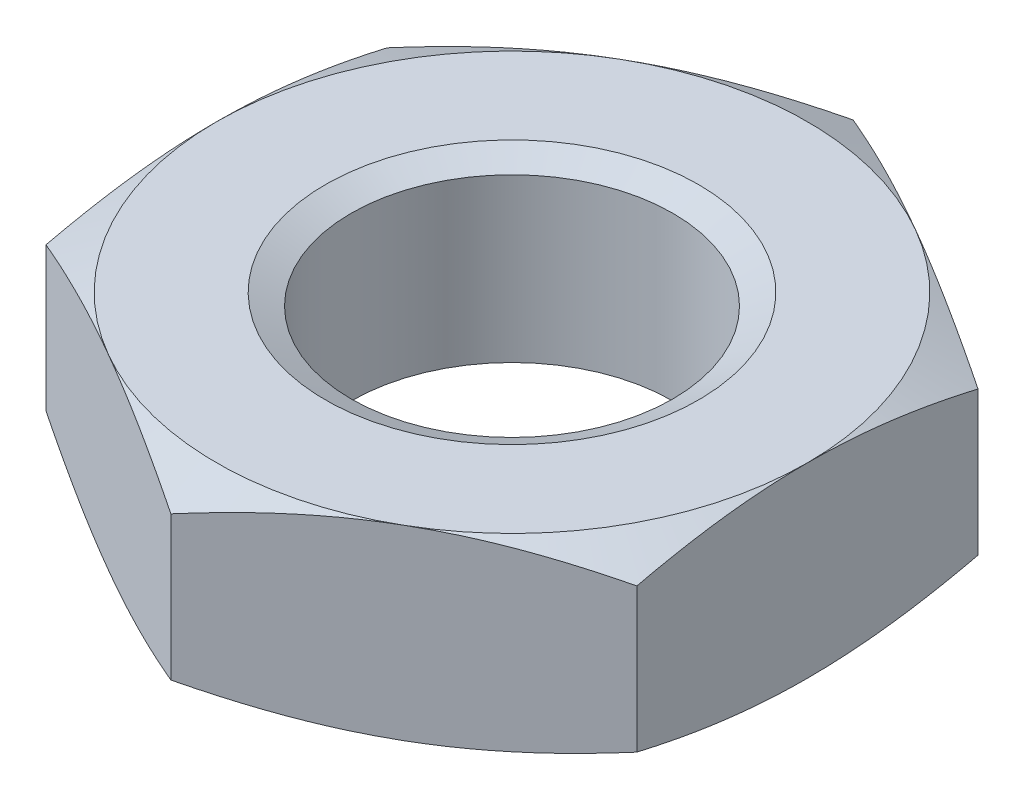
ISO-10303-21;
HEADER;
FILE_DESCRIPTION(('STEP AP214'),'2;1');
FILE_NAME('part.step','',(''),(''),'','','');
FILE_SCHEMA(('AUTOMOTIVE_DESIGN { 1 0 10303 214 1 1 1 1 }'));
ENDSEC;
DATA;
#1=APPLICATION_CONTEXT('core data for automotive mechanical design processes');
#2=APPLICATION_PROTOCOL_DEFINITION('international standard','automotive_design',2000,#1);
#3=PRODUCT_CONTEXT('',#1,'mechanical');
#4=PRODUCT('Part','Part','',(#3));
#5=PRODUCT_RELATED_PRODUCT_CATEGORY('part','',(#4));
#6=PRODUCT_DEFINITION_FORMATION('','',#4);
#7=PRODUCT_DEFINITION_CONTEXT('part definition',#1,'design');
#8=PRODUCT_DEFINITION('design','',#6,#7);
#9=PRODUCT_DEFINITION_SHAPE('','',#8);
#10=(LENGTH_UNIT() NAMED_UNIT(*) SI_UNIT(.MILLI.,.METRE.));
#11=(NAMED_UNIT(*) PLANE_ANGLE_UNIT() SI_UNIT($,.RADIAN.));
#12=(NAMED_UNIT(*) SI_UNIT($,.STERADIAN.) SOLID_ANGLE_UNIT());
#13=UNCERTAINTY_MEASURE_WITH_UNIT(LENGTH_MEASURE(1.E-05),#10,'distance_accuracy_value','');
#14=(GEOMETRIC_REPRESENTATION_CONTEXT(3) GLOBAL_UNCERTAINTY_ASSIGNED_CONTEXT((#13)) GLOBAL_UNIT_ASSIGNED_CONTEXT((#10,
#11,#12)) REPRESENTATION_CONTEXT('',''));
#15=CARTESIAN_POINT('',(0.,0.,0.));
#16=DIRECTION('',(0.,0.,1.));
#17=DIRECTION('',(1.,0.,0.));
#18=AXIS2_PLACEMENT_3D('',#15,#16,#17);
#19=CARTESIAN_POINT('',(0.,3.,-10.9696551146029));
#20=DIRECTION('',(0.,1.,0.));
#21=DIRECTION('',(0.,0.,1.));
#22=AXIS2_PLACEMENT_3D('',#19,#20,#21);
#23=PLANE('',#22);
#24=CARTESIAN_POINT('',(0.,3.,0.));
#25=DIRECTION('',(0.,-1.,0.));
#26=DIRECTION('',(0.,0.,-1.));
#27=AXIS2_PLACEMENT_3D('',#24,#25,#26);
#28=CIRCLE('',#27,9.50000000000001);
#29=CARTESIAN_POINT('',(-4.75000000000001,3.,8.22724133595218));
#30=VERTEX_POINT('',#29);
#31=CARTESIAN_POINT('',(-9.50000000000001,3.,0.));
#32=VERTEX_POINT('',#31);
#33=EDGE_CURVE('E298',#30,#32,#28,.T.);
#34=ORIENTED_EDGE('',*,*,#33,.F.);
#35=CARTESIAN_POINT('',(4.75,3.,8.22724133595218));
#36=VERTEX_POINT('',#35);
#37=EDGE_CURVE('E295',#36,#30,#28,.T.);
#38=ORIENTED_EDGE('',*,*,#37,.F.);
#39=CARTESIAN_POINT('',(9.50000000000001,3.,0.));
#40=VERTEX_POINT('',#39);
#41=EDGE_CURVE('E290',#40,#36,#28,.T.);
#42=ORIENTED_EDGE('',*,*,#41,.F.);
#43=CARTESIAN_POINT('',(4.75000000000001,3.,-8.22724133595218));
#44=VERTEX_POINT('',#43);
#45=EDGE_CURVE('E159',#44,#40,#28,.T.);
#46=ORIENTED_EDGE('',*,*,#45,.F.);
#47=CARTESIAN_POINT('',(-4.75000000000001,3.,-8.22724133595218));
#48=VERTEX_POINT('',#47);
#49=EDGE_CURVE('E291',#48,#44,#28,.T.);
#50=ORIENTED_EDGE('',*,*,#49,.F.);
#51=EDGE_CURVE('E296',#32,#48,#28,.T.);
#52=ORIENTED_EDGE('',*,*,#51,.F.);
#53=EDGE_LOOP('',(#34,#38,#42,#46,#50,#52));
#54=FACE_BOUND('',#53,.T.);
#55=CARTESIAN_POINT('',(0.,3.,0.));
#56=DIRECTION('',(0.,-1.,0.));
#57=DIRECTION('',(0.,0.,-1.));
#58=AXIS2_PLACEMENT_3D('',#55,#56,#57);
#59=CIRCLE('',#58,6.);
#60=CARTESIAN_POINT('',(0.,3.,-6.));
#61=VERTEX_POINT('',#60);
#62=EDGE_CURVE('E260',#61,#61,#59,.T.);
#63=ORIENTED_EDGE('',*,*,#62,.T.);
#64=EDGE_LOOP('',(#63));
#65=FACE_BOUND('',#64,.T.);
#66=ADVANCED_FACE('F38',(#54,#65),#23,.T.);
#67=CARTESIAN_POINT('',(0.,-3.,-10.9696551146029));
#68=DIRECTION('',(0.,1.,0.));
#69=DIRECTION('',(0.,0.,1.));
#70=AXIS2_PLACEMENT_3D('',#67,#68,#69);
#71=PLANE('',#70);
#72=CARTESIAN_POINT('',(0.,-3.,0.));
#73=DIRECTION('',(0.,-1.,0.));
#74=DIRECTION('',(0.,0.,-1.));
#75=AXIS2_PLACEMENT_3D('',#72,#73,#74);
#76=CIRCLE('',#75,6.);
#77=CARTESIAN_POINT('',(0.,-3.,-6.));
#78=VERTEX_POINT('',#77);
#79=EDGE_CURVE('E251',#78,#78,#76,.T.);
#80=ORIENTED_EDGE('',*,*,#79,.F.);
#81=EDGE_LOOP('',(#80));
#82=FACE_BOUND('',#81,.T.);
#83=CARTESIAN_POINT('',(0.,-3.,0.));
#84=DIRECTION('',(0.,-1.,0.));
#85=DIRECTION('',(0.,0.,-1.));
#86=AXIS2_PLACEMENT_3D('',#83,#84,#85);
#87=CIRCLE('',#86,9.50000000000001);
#88=CARTESIAN_POINT('',(4.75,-3.,8.22724133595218));
#89=VERTEX_POINT('',#88);
#90=CARTESIAN_POINT('',(-4.75000000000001,-3.,8.22724133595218));
#91=VERTEX_POINT('',#90);
#92=EDGE_CURVE('E284',#89,#91,#87,.T.);
#93=ORIENTED_EDGE('',*,*,#92,.T.);
#94=CARTESIAN_POINT('',(-9.50000000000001,-3.,0.));
#95=VERTEX_POINT('',#94);
#96=EDGE_CURVE('E282',#91,#95,#87,.T.);
#97=ORIENTED_EDGE('',*,*,#96,.T.);
#98=CARTESIAN_POINT('',(-4.75000000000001,-3.,-8.22724133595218));
#99=VERTEX_POINT('',#98);
#100=EDGE_CURVE('E158',#95,#99,#87,.T.);
#101=ORIENTED_EDGE('',*,*,#100,.T.);
#102=CARTESIAN_POINT('',(4.75000000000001,-3.,-8.22724133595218));
#103=VERTEX_POINT('',#102);
#104=EDGE_CURVE('E133',#99,#103,#87,.T.);
#105=ORIENTED_EDGE('',*,*,#104,.T.);
#106=CARTESIAN_POINT('',(9.50000000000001,-3.,0.));
#107=VERTEX_POINT('',#106);
#108=EDGE_CURVE('E144',#103,#107,#87,.T.);
#109=ORIENTED_EDGE('',*,*,#108,.T.);
#110=EDGE_CURVE('E152',#107,#89,#87,.T.);
#111=ORIENTED_EDGE('',*,*,#110,.T.);
#112=EDGE_LOOP('',(#93,#97,#101,#105,#109,#111));
#113=FACE_BOUND('',#112,.T.);
#114=ADVANCED_FACE('F155',(#82,#113),#71,.F.);
#115=CARTESIAN_POINT('',(0.,2.61444946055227,0.));
#116=DIRECTION('',(0.,1.,0.));
#117=DIRECTION('',(0.,0.,1.));
#118=AXIS2_PLACEMENT_3D('',#115,#116,#117);
#119=CONICAL_SURFACE('',#118,5.17318419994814,1.13446401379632);
#120=ORIENTED_EDGE('',*,*,#62,.F.);
#121=EDGE_LOOP('',(#120));
#122=FACE_BOUND('',#121,.T.);
#123=CARTESIAN_POINT('',(0.,2.61444946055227,0.));
#124=DIRECTION('',(0.,-1.,0.));
#125=DIRECTION('',(0.,0.,-1.));
#126=AXIS2_PLACEMENT_3D('',#123,#124,#125);
#127=CIRCLE('',#126,5.17318419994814);
#128=CARTESIAN_POINT('',(0.,2.61444946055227,-5.17318419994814));
#129=VERTEX_POINT('',#128);
#130=EDGE_CURVE('E257',#129,#129,#127,.T.);
#131=ORIENTED_EDGE('',*,*,#130,.T.);
#132=EDGE_LOOP('',(#131));
#133=FACE_BOUND('',#132,.T.);
#134=ADVANCED_FACE('F348',(#122,#133),#119,.F.);
#135=CARTESIAN_POINT('',(0.,3.,0.));
#136=DIRECTION('',(0.,-1.,0.));
#137=DIRECTION('',(0.,0.,-1.));
#138=AXIS2_PLACEMENT_3D('',#135,#136,#137);
#139=CYLINDRICAL_SURFACE('',#138,5.17318419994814);
#140=ORIENTED_EDGE('',*,*,#130,.F.);
#141=EDGE_LOOP('',(#140));
#142=FACE_BOUND('',#141,.T.);
#143=CARTESIAN_POINT('',(0.,-2.61444946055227,0.));
#144=DIRECTION('',(0.,-1.,0.));
#145=DIRECTION('',(0.,0.,-1.));
#146=AXIS2_PLACEMENT_3D('',#143,#144,#145);
#147=CIRCLE('',#146,5.17318419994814);
#148=CARTESIAN_POINT('',(0.,-2.61444946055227,-5.17318419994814));
#149=VERTEX_POINT('',#148);
#150=EDGE_CURVE('E254',#149,#149,#147,.T.);
#151=ORIENTED_EDGE('',*,*,#150,.T.);
#152=EDGE_LOOP('',(#151));
#153=FACE_BOUND('',#152,.T.);
#154=ADVANCED_FACE('F353',(#142,#153),#139,.F.);
#155=CARTESIAN_POINT('',(0.,-3.,0.));
#156=DIRECTION('',(0.,-1.,0.));
#157=DIRECTION('',(0.,0.,-1.));
#158=AXIS2_PLACEMENT_3D('',#155,#156,#157);
#159=CONICAL_SURFACE('',#158,6.,1.13446401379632);
#160=ORIENTED_EDGE('',*,*,#150,.F.);
#161=EDGE_LOOP('',(#160));
#162=FACE_BOUND('',#161,.T.);
#163=ORIENTED_EDGE('',*,*,#79,.T.);
#164=EDGE_LOOP('',(#163));
#165=FACE_BOUND('',#164,.T.);
#166=ADVANCED_FACE('F193',(#162,#165),#159,.F.);
#167=CARTESIAN_POINT('',(0.,-2.31468856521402,0.));
#168=DIRECTION('',(0.,1.,0.));
#169=DIRECTION('',(0.,0.,1.));
#170=AXIS2_PLACEMENT_3D('',#167,#168,#169);
#171=CONICAL_SURFACE('',#170,10.9696551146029,1.13446401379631);
#172=ORIENTED_EDGE('',*,*,#92,.F.);
#173=CARTESIAN_POINT('',(-0.000200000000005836,-2.31463471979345,10.9697705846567));
#174=CARTESIAN_POINT('',(0.287096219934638,-2.3919802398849,10.8039000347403));
#175=CARTESIAN_POINT('',(0.575452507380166,-2.4643586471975,10.6374174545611));
#176=CARTESIAN_POINT('',(1.15432895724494,-2.59745715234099,10.3032029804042));
#177=CARTESIAN_POINT('',(1.44485020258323,-2.65817094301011,10.1354704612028));
#178=CARTESIAN_POINT('',(2.02806320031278,-2.76617947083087,9.79875227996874));
#179=CARTESIAN_POINT('',(2.32075673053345,-2.81346158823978,9.62976559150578));
#180=CARTESIAN_POINT('',(2.90764430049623,-2.89286146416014,9.29092589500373));
#181=CARTESIAN_POINT('',(3.20183804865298,-2.92498206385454,9.12107305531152));
#182=CARTESIAN_POINT('',(3.78512703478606,-2.97228457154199,8.78431100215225));
#183=CARTESIAN_POINT('',(4.07420151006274,-2.98780388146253,8.6174137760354));
#184=CARTESIAN_POINT('',(4.6526838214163,-3.00242203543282,8.28342685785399));
#185=CARTESIAN_POINT('',(4.9420916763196,-3.00151990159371,8.11633715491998));
#186=CARTESIAN_POINT('',(5.52024486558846,-2.98334062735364,7.78254025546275));
#187=CARTESIAN_POINT('',(5.80899056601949,-2.96607874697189,7.61583284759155));
#188=CARTESIAN_POINT('',(6.38542685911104,-2.91592315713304,7.28302719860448));
#189=CARTESIAN_POINT('',(6.67311754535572,-2.88303086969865,7.11692890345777));
#190=CARTESIAN_POINT('',(7.17283351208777,-2.81323110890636,6.82841775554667));
#191=CARTESIAN_POINT('',(7.38520520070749,-2.77955632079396,6.70580490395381));
#192=CARTESIAN_POINT('',(7.80897776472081,-2.70493481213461,6.46113970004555));
#193=CARTESIAN_POINT('',(8.02037868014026,-2.66398839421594,6.33908732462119));
#194=CARTESIAN_POINT('',(8.44384293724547,-2.57513594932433,6.09460012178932));
#195=CARTESIAN_POINT('',(8.65589776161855,-2.52717620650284,5.97217021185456));
#196=CARTESIAN_POINT('',(9.07888620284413,-2.42524395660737,5.72795772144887));
#197=CARTESIAN_POINT('',(9.28982000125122,-2.37127245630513,5.60617503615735));
#198=CARTESIAN_POINT('',(9.50019999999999,-2.31463471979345,5.48471208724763));
#199=B_SPLINE_CURVE_WITH_KNOTS('',3,(#173,#174,#175,#176,#177,#178,#179,#180,#181,#182,#183,
#184,#185,#186,#187,#188,#189,#190,#191,#192,#193,#194,#195,#196,#197,#198),.UNSPECIFIED.,.F.,
.F.,(4,2,2,2,2,2,2,2,2,2,2,2,4),(0.,1.02197309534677,2.04449723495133,3.06797893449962,
4.09126876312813,5.09334145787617,6.09547382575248,7.09667234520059,8.09777979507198,
8.84025230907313,9.58269393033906,10.3311528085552,11.0794865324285),.UNSPECIFIED.);
#200=CARTESIAN_POINT('',(0.,-2.31468856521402,10.9696551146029));
#201=VERTEX_POINT('',#200);
#202=EDGE_CURVE('E572',#201,#89,#199,.T.);
#203=ORIENTED_EDGE('',*,*,#202,.F.);
#204=CARTESIAN_POINT('',(-9.5002,-2.31463471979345,5.48471208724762));
#205=CARTESIAN_POINT('',(-9.21290378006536,-2.3919802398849,5.65058263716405));
#206=CARTESIAN_POINT('',(-8.92454749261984,-2.4643586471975,5.81706521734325));
#207=CARTESIAN_POINT('',(-8.34567104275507,-2.59745715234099,6.15127969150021));
#208=CARTESIAN_POINT('',(-8.05514979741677,-2.65817094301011,6.31901221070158));
#209=CARTESIAN_POINT('',(-7.47193679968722,-2.76617947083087,6.65573039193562));
#210=CARTESIAN_POINT('',(-7.17924326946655,-2.81346158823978,6.82471708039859));
#211=CARTESIAN_POINT('',(-6.59235569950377,-2.89286146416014,7.16355677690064));
#212=CARTESIAN_POINT('',(-6.29816195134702,-2.92498206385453,7.33340961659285));
#213=CARTESIAN_POINT('',(-5.71487296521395,-2.97228457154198,7.67017166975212));
#214=CARTESIAN_POINT('',(-5.42579848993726,-2.98780388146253,7.83706889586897));
#215=CARTESIAN_POINT('',(-4.84731617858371,-3.00242203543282,8.17105581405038));
#216=CARTESIAN_POINT('',(-4.55790832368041,-3.00151990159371,8.33814551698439));
#217=CARTESIAN_POINT('',(-3.97975513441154,-2.98334062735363,8.67194241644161));
#218=CARTESIAN_POINT('',(-3.69100943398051,-2.96607874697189,8.83864982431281));
#219=CARTESIAN_POINT('',(-3.11457314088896,-2.91592315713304,9.17145547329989));
#220=CARTESIAN_POINT('',(-2.82688245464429,-2.88303086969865,9.3375537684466));
#221=CARTESIAN_POINT('',(-2.32716648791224,-2.81323110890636,9.6260649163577));
#222=CARTESIAN_POINT('',(-2.11479479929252,-2.77955632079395,9.74867776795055));
#223=CARTESIAN_POINT('',(-1.6910222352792,-2.70493481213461,9.99334297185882));
#224=CARTESIAN_POINT('',(-1.47962131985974,-2.66398839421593,10.1153953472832));
#225=CARTESIAN_POINT('',(-1.05615706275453,-2.57513594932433,10.3598825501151));
#226=CARTESIAN_POINT('',(-0.844102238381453,-2.52717620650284,10.4823124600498));
#227=CARTESIAN_POINT('',(-0.421113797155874,-2.42524395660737,10.7265249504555));
#228=CARTESIAN_POINT('',(-0.210179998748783,-2.37127245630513,10.848307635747));
#229=CARTESIAN_POINT('',(0.000199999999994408,-2.31463471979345,10.9697705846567));
#230=B_SPLINE_CURVE_WITH_KNOTS('',3,(#204,#205,#206,#207,#208,#209,#210,#211,#212,#213,#214,
#215,#216,#217,#218,#219,#220,#221,#222,#223,#224,#225,#226,#227,#228,#229),.UNSPECIFIED.,.F.,
.F.,(4,2,2,2,2,2,2,2,2,2,2,2,4),(0.,1.02197309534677,2.04449723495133,3.06797893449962,
4.09126876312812,5.09334145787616,6.09547382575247,7.09667234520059,8.09777979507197,
8.84025230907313,9.58269393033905,10.3311528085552,11.0794865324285),.UNSPECIFIED.);
#231=EDGE_CURVE('E213',#91,#201,#230,.T.);
#232=ORIENTED_EDGE('',*,*,#231,.F.);
#233=EDGE_LOOP('',(#172,#203,#232));
#234=FACE_BOUND('',#233,.T.);
#235=ADVANCED_FACE('F360',(#234),#171,.T.);
#236=ORIENTED_EDGE('',*,*,#110,.F.);
#237=CARTESIAN_POINT('',(9.49999999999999,0.668970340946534,-14.5396705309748));
#238=CARTESIAN_POINT('',(9.49999999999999,0.502355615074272,-14.1127317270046));
#239=CARTESIAN_POINT('',(9.49999999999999,0.337561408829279,-13.6850690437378));
#240=CARTESIAN_POINT('',(9.49999999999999,0.0126466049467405,-12.827912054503));
#241=CARTESIAN_POINT('',(9.49999999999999,-0.147473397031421,-12.3984175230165));
#242=CARTESIAN_POINT('',(9.49999999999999,-0.462497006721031,-11.5358628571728));
#243=CARTESIAN_POINT('',(9.49999999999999,-0.617381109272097,-11.1027955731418));
#244=CARTESIAN_POINT('',(9.49999999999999,-0.919891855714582,-10.2341405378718));
#245=CARTESIAN_POINT('',(9.49999999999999,-1.06751875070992,-9.79855287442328));
#246=CARTESIAN_POINT('',(9.49999999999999,-1.35174201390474,-8.93016285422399));
#247=CARTESIAN_POINT('',(9.49999999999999,-1.48845860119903,-8.49740004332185));
#248=CARTESIAN_POINT('',(9.49999999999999,-1.7506615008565,-7.6284359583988));
#249=CARTESIAN_POINT('',(9.49999999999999,-1.8761472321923,-7.19223450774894));
#250=CARTESIAN_POINT('',(9.49999999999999,-2.11279756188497,-6.31639229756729));
#251=CARTESIAN_POINT('',(9.49999999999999,-2.22397611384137,-5.87675533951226));
#252=CARTESIAN_POINT('',(9.49999999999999,-2.42853145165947,-4.99335349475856));
#253=CARTESIAN_POINT('',(9.49999999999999,-2.52191072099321,-4.54958919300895));
#254=CARTESIAN_POINT('',(9.49999999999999,-2.6606442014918,-3.79933724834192));
#255=CARTESIAN_POINT('',(9.49999999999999,-2.71183849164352,-3.49392988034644));
#256=CARTESIAN_POINT('',(9.49999999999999,-2.80269954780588,-2.88139353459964));
#257=CARTESIAN_POINT('',(9.49999999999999,-2.84236659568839,-2.57426459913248));
#258=CARTESIAN_POINT('',(9.49999999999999,-2.90896894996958,-1.95876414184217));
#259=CARTESIAN_POINT('',(9.49999999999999,-2.93591030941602,-1.65039328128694));
#260=CARTESIAN_POINT('',(9.49999999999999,-2.9761814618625,-1.03275641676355));
#261=CARTESIAN_POINT('',(9.49999999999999,-2.98951136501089,-0.723490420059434));
#262=CARTESIAN_POINT('',(9.49999999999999,-3.00210305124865,-0.103357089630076));
#263=CARTESIAN_POINT('',(9.49999999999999,-3.00130496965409,0.207511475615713));
#264=CARTESIAN_POINT('',(9.49999999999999,-2.98552397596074,0.828887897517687));
#265=CARTESIAN_POINT('',(9.49999999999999,-2.97054087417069,1.13939574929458));
#266=CARTESIAN_POINT('',(9.49999999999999,-2.92693002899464,1.7594954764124));
#267=CARTESIAN_POINT('',(9.49999999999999,-2.89829994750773,2.06908718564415));
#268=CARTESIAN_POINT('',(9.49999999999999,-2.82835889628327,2.68680656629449));
#269=CARTESIAN_POINT('',(9.49999999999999,-2.7870483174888,2.99493428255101));
#270=CARTESIAN_POINT('',(9.49999999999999,-2.67642858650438,3.71745598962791));
#271=CARTESIAN_POINT('',(9.49999999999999,-2.6023820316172,4.1311241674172));
#272=CARTESIAN_POINT('',(9.49999999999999,-2.43665717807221,4.95495044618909));
#273=CARTESIAN_POINT('',(9.49999999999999,-2.34497487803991,5.3651077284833));
#274=CARTESIAN_POINT('',(9.49999999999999,-2.14707643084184,6.18227931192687));
#275=CARTESIAN_POINT('',(9.49999999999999,-2.04084662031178,6.58929027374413));
#276=CARTESIAN_POINT('',(9.49999999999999,-1.81669731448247,7.40002671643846));
#277=CARTESIAN_POINT('',(9.49999999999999,-1.69877855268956,7.8037524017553));
#278=CARTESIAN_POINT('',(9.49999999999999,-1.45285081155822,8.61054836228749));
#279=CARTESIAN_POINT('',(9.5,-1.32478953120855,9.01360260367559));
#280=CARTESIAN_POINT('',(9.5,-1.06100984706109,9.81719096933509));
#281=CARTESIAN_POINT('',(9.5,-0.925291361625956,10.2177250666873));
#282=CARTESIAN_POINT('',(9.5,-0.64773313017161,11.0164402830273));
#283=CARTESIAN_POINT('',(9.5,-0.505896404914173,11.4146224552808));
#284=CARTESIAN_POINT('',(9.5,-0.217190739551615,12.2091507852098));
#285=CARTESIAN_POINT('',(9.5,-0.0703218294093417,12.6054969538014));
#286=CARTESIAN_POINT('',(9.5,0.228120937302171,13.3981671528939));
#287=CARTESIAN_POINT('',(9.5,0.379710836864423,13.7944851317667));
#288=CARTESIAN_POINT('',(9.5,0.686334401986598,14.5857880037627));
#289=CARTESIAN_POINT('',(9.5,0.841368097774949,14.9807728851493));
#290=CARTESIAN_POINT('',(9.5,1.310779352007,16.164126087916));
#291=CARTESIAN_POINT('',(9.5,1.62943155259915,16.9507994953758));
#292=CARTESIAN_POINT('',(9.5,2.11140168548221,18.1232822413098));
#293=CARTESIAN_POINT('',(9.5,2.27166621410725,18.5103557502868));
#294=CARTESIAN_POINT('',(9.5,2.59389676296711,19.2837954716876));
#295=CARTESIAN_POINT('',(9.5,2.75586278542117,19.6701616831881));
#296=CARTESIAN_POINT('',(9.5,3.08121472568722,20.4421945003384));
#297=CARTESIAN_POINT('',(9.5,3.24460032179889,20.827861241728));
#298=CARTESIAN_POINT('',(9.5,3.5726376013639,21.5986532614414));
#299=CARTESIAN_POINT('',(9.5,3.73728927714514,21.9837785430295));
#300=CARTESIAN_POINT('',(9.5,3.9024804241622,22.3686717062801));
#301=B_SPLINE_CURVE_WITH_KNOTS('',3,(#237,#238,#239,#240,#241,#242,#243,#244,#245,#246,#247,
#248,#249,#250,#251,#252,#253,#254,#255,#256,#257,#258,#259,#260,#261,#262,#263,#264,#265,#266,
#267,#268,#269,#270,#271,#272,#273,#274,#275,#276,#277,#278,#279,#280,#281,#282,#283,#284,#285,
#286,#287,#288,#289,#290,#291,#292,#293,#294,#295,#296,#297,#298,#299,#300),.UNSPECIFIED.,.F.,
.F.,(4,2,2,2,2,2,2,2,2,2,2,2,2,2,2,2,2,2,2,2,2,2,2,2,2,2,2,2,2,2,2,4),(0.,1.37490904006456,
2.74999253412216,4.1297335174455,5.50942672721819,6.87084242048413,8.23232850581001,
9.59247652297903,10.9524346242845,11.8812525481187,12.8100477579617,13.7384007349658,
14.6667461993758,15.5990262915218,16.5313188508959,17.4637711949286,18.3961947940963,
19.6564374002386,20.9169662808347,22.1786873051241,23.4403292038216,24.7089635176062,
25.9776113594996,27.2456398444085,28.5136607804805,29.7866012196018,31.0595528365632,
33.6057560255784,34.8625740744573,36.1193937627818,37.3759356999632,38.6324700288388),.UNSPECIFIED.);
#302=CARTESIAN_POINT('',(9.49999999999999,-2.31468856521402,5.48482755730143));
#303=VERTEX_POINT('',#302);
#304=EDGE_CURVE('E575',#303,#107,#301,.F.);
#305=ORIENTED_EDGE('',*,*,#304,.F.);
#306=EDGE_CURVE('E205',#89,#303,#199,.T.);
#307=ORIENTED_EDGE('',*,*,#306,.F.);
#308=EDGE_LOOP('',(#236,#305,#307));
#309=FACE_BOUND('',#308,.T.);
#310=ADVANCED_FACE('F190',(#309),#171,.T.);
#311=CARTESIAN_POINT('',(9.49999999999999,-2.31468856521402,-5.48482755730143));
#312=VERTEX_POINT('',#311);
#313=EDGE_CURVE('E147',#107,#312,#301,.F.);
#314=ORIENTED_EDGE('',*,*,#313,.F.);
#315=ORIENTED_EDGE('',*,*,#108,.F.);
#316=CARTESIAN_POINT('',(9.50019999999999,-2.31463471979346,-5.48471208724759));
#317=CARTESIAN_POINT('',(9.21290378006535,-2.39198023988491,-5.65058263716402));
#318=CARTESIAN_POINT('',(8.92454749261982,-2.46435864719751,-5.81706521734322));
#319=CARTESIAN_POINT('',(8.34567104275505,-2.597457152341,-6.15127969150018));
#320=CARTESIAN_POINT('',(8.05514979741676,-2.65817094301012,-6.31901221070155));
#321=CARTESIAN_POINT('',(7.47193679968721,-2.76617947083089,-6.65573039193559));
#322=CARTESIAN_POINT('',(7.17924326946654,-2.8134615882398,-6.82471708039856));
#323=CARTESIAN_POINT('',(6.59235569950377,-2.89286146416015,-7.16355677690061));
#324=CARTESIAN_POINT('',(6.29816195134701,-2.92498206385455,-7.33340961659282));
#325=CARTESIAN_POINT('',(5.71487296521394,-2.972284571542,-7.67017166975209));
#326=CARTESIAN_POINT('',(5.42579848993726,-2.98780388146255,-7.83706889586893));
#327=CARTESIAN_POINT('',(4.8473161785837,-3.00242203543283,-8.17105581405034));
#328=CARTESIAN_POINT('',(4.5579083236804,-3.00151990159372,-8.33814551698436));
#329=CARTESIAN_POINT('',(3.97975513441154,-2.98334062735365,-8.67194241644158));
#330=CARTESIAN_POINT('',(3.69100943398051,-2.96607874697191,-8.83864982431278));
#331=CARTESIAN_POINT('',(3.11457314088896,-2.91592315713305,-9.17145547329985));
#332=CARTESIAN_POINT('',(2.82688245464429,-2.88303086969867,-9.33755376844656));
#333=CARTESIAN_POINT('',(2.32716648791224,-2.81323110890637,-9.62606491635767));
#334=CARTESIAN_POINT('',(2.11479479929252,-2.77955632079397,-9.74867776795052));
#335=CARTESIAN_POINT('',(1.69102223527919,-2.70493481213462,-9.99334297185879));
#336=CARTESIAN_POINT('',(1.47962131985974,-2.66398839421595,-10.1153953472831));
#337=CARTESIAN_POINT('',(1.05615706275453,-2.57513594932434,-10.359882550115));
#338=CARTESIAN_POINT('',(0.844102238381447,-2.52717620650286,-10.4823124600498));
#339=CARTESIAN_POINT('',(0.421113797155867,-2.42524395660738,-10.7265249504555));
#340=CARTESIAN_POINT('',(0.210179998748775,-2.37127245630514,-10.848307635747));
#341=CARTESIAN_POINT('',(-0.00020000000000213,-2.31463471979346,-10.9697705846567));
#342=B_SPLINE_CURVE_WITH_KNOTS('',3,(#316,#317,#318,#319,#320,#321,#322,#323,#324,#325,#326,
#327,#328,#329,#330,#331,#332,#333,#334,#335,#336,#337,#338,#339,#340,#341),.UNSPECIFIED.,.F.,
.F.,(4,2,2,2,2,2,2,2,2,2,2,2,4),(0.,1.02197309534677,2.04449723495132,3.06797893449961,
4.09126876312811,5.09334145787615,6.09547382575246,7.09667234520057,8.09777979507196,
8.84025230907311,9.58269393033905,10.3311528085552,11.0794865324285),.UNSPECIFIED.);
#343=EDGE_CURVE('E140',#312,#103,#342,.T.);
#344=ORIENTED_EDGE('',*,*,#343,.F.);
#345=EDGE_LOOP('',(#314,#315,#344));
#346=FACE_BOUND('',#345,.T.);
#347=ADVANCED_FACE('F145',(#346),#171,.T.);
#348=ORIENTED_EDGE('',*,*,#104,.F.);
#349=CARTESIAN_POINT('',(0.000199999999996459,-2.31463471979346,-10.9697705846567));
#350=CARTESIAN_POINT('',(-0.287096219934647,-2.39198023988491,-10.8039000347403));
#351=CARTESIAN_POINT('',(-0.575452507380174,-2.46435864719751,-10.6374174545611));
#352=CARTESIAN_POINT('',(-1.15432895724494,-2.597457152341,-10.3032029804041));
#353=CARTESIAN_POINT('',(-1.44485020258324,-2.65817094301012,-10.1354704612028));
#354=CARTESIAN_POINT('',(-2.02806320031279,-2.76617947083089,-9.79875227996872));
#355=CARTESIAN_POINT('',(-2.32075673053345,-2.81346158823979,-9.62976559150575));
#356=CARTESIAN_POINT('',(-2.90764430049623,-2.89286146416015,-9.2909258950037));
#357=CARTESIAN_POINT('',(-3.20183804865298,-2.92498206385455,-9.12107305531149));
#358=CARTESIAN_POINT('',(-3.78512703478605,-2.972284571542,-8.78431100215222));
#359=CARTESIAN_POINT('',(-4.07420151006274,-2.98780388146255,-8.61741377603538));
#360=CARTESIAN_POINT('',(-4.65268382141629,-3.00242203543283,-8.28342685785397));
#361=CARTESIAN_POINT('',(-4.94209167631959,-3.00151990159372,-8.11633715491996));
#362=CARTESIAN_POINT('',(-5.52024486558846,-2.98334062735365,-7.78254025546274));
#363=CARTESIAN_POINT('',(-5.80899056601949,-2.9660787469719,-7.61583284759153));
#364=CARTESIAN_POINT('',(-6.38542685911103,-2.91592315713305,-7.28302719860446));
#365=CARTESIAN_POINT('',(-6.67311754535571,-2.88303086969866,-7.11692890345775));
#366=CARTESIAN_POINT('',(-7.17283351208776,-2.81323110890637,-6.82841775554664));
#367=CARTESIAN_POINT('',(-7.38520520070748,-2.77955632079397,-6.70580490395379));
#368=CARTESIAN_POINT('',(-7.8089777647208,-2.70493481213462,-6.46113970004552));
#369=CARTESIAN_POINT('',(-8.02037868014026,-2.66398839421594,-6.33908732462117));
#370=CARTESIAN_POINT('',(-8.44384293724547,-2.57513594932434,-6.09460012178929));
#371=CARTESIAN_POINT('',(-8.65589776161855,-2.52717620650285,-5.97217021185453));
#372=CARTESIAN_POINT('',(-9.07888620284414,-2.42524395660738,-5.72795772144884));
#373=CARTESIAN_POINT('',(-9.28982000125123,-2.37127245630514,-5.60617503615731));
#374=CARTESIAN_POINT('',(-9.50020000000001,-2.31463471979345,-5.48471208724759));
#375=B_SPLINE_CURVE_WITH_KNOTS('',3,(#349,#350,#351,#352,#353,#354,#355,#356,#357,#358,#359,
#360,#361,#362,#363,#364,#365,#366,#367,#368,#369,#370,#371,#372,#373,#374),.UNSPECIFIED.,.F.,
.F.,(4,2,2,2,2,2,2,2,2,2,2,2,4),(0.,1.02197309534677,2.04449723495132,3.06797893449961,
4.09126876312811,5.09334145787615,6.09547382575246,7.09667234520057,8.09777979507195,
8.84025230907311,9.58269393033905,10.3311528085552,11.0794865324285),.UNSPECIFIED.);
#376=CARTESIAN_POINT('',(0.,-2.31468856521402,-10.9696551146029));
#377=VERTEX_POINT('',#376);
#378=EDGE_CURVE('E136',#377,#99,#375,.T.);
#379=ORIENTED_EDGE('',*,*,#378,.F.);
#380=EDGE_CURVE('E129',#103,#377,#342,.T.);
#381=ORIENTED_EDGE('',*,*,#380,.F.);
#382=EDGE_LOOP('',(#348,#379,#381));
#383=FACE_BOUND('',#382,.T.);
#384=ADVANCED_FACE('F131',(#383),#171,.T.);
#385=ORIENTED_EDGE('',*,*,#100,.F.);
#386=CARTESIAN_POINT('',(-9.50000000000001,0.668971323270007,-14.5396730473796));
#387=CARTESIAN_POINT('',(-9.50000000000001,0.502356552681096,-14.1127341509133));
#388=CARTESIAN_POINT('',(-9.50000000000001,0.33756230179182,-13.6850713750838));
#389=CARTESIAN_POINT('',(-9.50000000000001,0.0126474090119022,-12.8279142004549));
#390=CARTESIAN_POINT('',(-9.50000000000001,-0.147472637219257,-12.398419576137));
#391=CARTESIAN_POINT('',(-9.50000000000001,-0.462496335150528,-11.5358647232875));
#392=CARTESIAN_POINT('',(-9.50000000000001,-0.617380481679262,-11.1027973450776));
#393=CARTESIAN_POINT('',(-9.50000000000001,-0.919891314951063,-10.2341421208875));
#394=CARTESIAN_POINT('',(-9.50000000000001,-1.06751825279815,-9.79855436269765));
#395=CARTESIAN_POINT('',(-9.50000000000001,-1.35174159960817,-8.93016415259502));
#396=CARTESIAN_POINT('',(-9.50000000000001,-1.4884582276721,-8.49740124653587));
#397=CARTESIAN_POINT('',(-9.50000000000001,-1.75066120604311,-7.62843697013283));
#398=CARTESIAN_POINT('',(-9.50000000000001,-1.87614697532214,-7.19223542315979));
#399=CARTESIAN_POINT('',(-9.50000000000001,-2.1127973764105,-6.31639301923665));
#400=CARTESIAN_POINT('',(-9.50000000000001,-2.22397596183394,-5.87675596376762));
#401=CARTESIAN_POINT('',(-9.50000000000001,-2.42853136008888,-4.99335392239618));
#402=CARTESIAN_POINT('',(-9.50000000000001,-2.52191065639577,-4.54958952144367));
#403=CARTESIAN_POINT('',(-9.50000000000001,-2.66064415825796,-3.79933749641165));
#404=CARTESIAN_POINT('',(-9.50000000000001,-2.71183844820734,-3.49393014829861));
#405=CARTESIAN_POINT('',(-9.50000000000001,-2.80269950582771,-2.88139384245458));
#406=CARTESIAN_POINT('',(-9.50000000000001,-2.84236655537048,-2.57426492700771));
#407=CARTESIAN_POINT('',(-9.50000000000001,-2.90896891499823,-1.95876450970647));
#408=CARTESIAN_POINT('',(-9.50000000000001,-2.93591027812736,-1.65039366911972));
#409=CARTESIAN_POINT('',(-9.50000000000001,-2.97618143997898,-1.03275684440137));
#410=CARTESIAN_POINT('',(-9.50000000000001,-2.98951134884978,-0.723490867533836));
#411=CARTESIAN_POINT('',(-9.50000000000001,-3.00210304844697,-0.103357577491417));
#412=CARTESIAN_POINT('',(-9.50000000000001,-3.00130497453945,0.207510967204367));
#413=CARTESIAN_POINT('',(-9.50000000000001,-2.98552399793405,0.828887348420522));
#414=CARTESIAN_POINT('',(-9.50000000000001,-2.97054090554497,1.13939518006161));
#415=CARTESIAN_POINT('',(-9.50000000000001,-2.92693008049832,1.75949486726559));
#416=CARTESIAN_POINT('',(-9.50000000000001,-2.89830000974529,2.06908655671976));
#417=CARTESIAN_POINT('',(-9.50000000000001,-2.82835898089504,2.68680589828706));
#418=CARTESIAN_POINT('',(-9.50000000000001,-2.78704841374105,2.99493359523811));
#419=CARTESIAN_POINT('',(-9.50000000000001,-2.67642870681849,3.71745528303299));
#420=CARTESIAN_POINT('',(-9.50000000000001,-2.60238216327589,4.13112346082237));
#421=CARTESIAN_POINT('',(-9.50000000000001,-2.4366573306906,4.95494973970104));
#422=CARTESIAN_POINT('',(-9.50000000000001,-2.34497504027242,5.36510702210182));
#423=CARTESIAN_POINT('',(-9.50000000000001,-2.14707661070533,6.18227860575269));
#424=CARTESIAN_POINT('',(-9.50000000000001,-2.04084680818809,6.58928956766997));
#425=CARTESIAN_POINT('',(-9.50000000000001,-1.81669751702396,7.40002601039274));
#426=CARTESIAN_POINT('',(-9.50000000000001,-1.69877876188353,7.80375169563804));
#427=CARTESIAN_POINT('',(-9.50000000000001,-1.45285103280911,8.61054765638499));
#428=CARTESIAN_POINT('',(-9.5,-1.32478975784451,9.01360189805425));
#429=CARTESIAN_POINT('',(-9.5,-1.06101008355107,9.81719026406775));
#430=CARTESIAN_POINT('',(-9.5,-0.925291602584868,10.2177243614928));
#431=CARTESIAN_POINT('',(-9.5,-0.647733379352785,11.0164395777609));
#432=CARTESIAN_POINT('',(-9.5,-0.505896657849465,11.4146217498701));
#433=CARTESIAN_POINT('',(-9.5,-0.217190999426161,12.209150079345));
#434=CARTESIAN_POINT('',(-9.5,-0.0703220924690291,12.6054962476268));
#435=CARTESIAN_POINT('',(-9.5,0.228120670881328,13.3981664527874));
#436=CARTESIAN_POINT('',(-9.5,0.379710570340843,13.7944844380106));
#437=CARTESIAN_POINT('',(-9.5,0.686334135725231,14.5857873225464));
#438=CARTESIAN_POINT('',(-9.5,0.841367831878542,14.9807722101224));
#439=CARTESIAN_POINT('',(-9.5,1.31077908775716,16.1641254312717));
#440=CARTESIAN_POINT('',(-9.5,1.62943129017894,16.9507988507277));
#441=CARTESIAN_POINT('',(-9.5,2.11140142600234,18.1232816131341));
#442=CARTESIAN_POINT('',(-9.5,2.27166595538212,18.510355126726));
#443=CARTESIAN_POINT('',(-9.5,2.59389650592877,19.2837948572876));
#444=CARTESIAN_POINT('',(-9.5,2.75586252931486,19.6701610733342));
#445=CARTESIAN_POINT('',(-9.5,3.0812144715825,20.442193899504));
#446=CARTESIAN_POINT('',(-9.5,3.24460006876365,20.8278606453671));
#447=CARTESIAN_POINT('',(-9.5,3.57263735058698,21.5986526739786));
#448=CARTESIAN_POINT('',(-9.5,3.73728902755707,21.9837779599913));
#449=CARTESIAN_POINT('',(-9.5,3.90248017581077,22.3686711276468));
#450=B_SPLINE_CURVE_WITH_KNOTS('',3,(#386,#387,#388,#389,#390,#391,#392,#393,#394,#395,#396,
#397,#398,#399,#400,#401,#402,#403,#404,#405,#406,#407,#408,#409,#410,#411,#412,#413,#414,#415,
#416,#417,#418,#419,#420,#421,#422,#423,#424,#425,#426,#427,#428,#429,#430,#431,#432,#433,#434,
#435,#436,#437,#438,#439,#440,#441,#442,#443,#444,#445,#446,#447,#448,#449),.UNSPECIFIED.,.F.,
.F.,(4,2,2,2,2,2,2,2,2,2,2,2,2,2,2,2,2,2,2,2,2,2,2,2,2,2,2,2,2,2,2,4),(0.,1.37490934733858,
2.74999314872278,4.12973444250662,5.50942796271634,6.87084396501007,8.23233035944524,
9.5924786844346,10.9524370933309,11.8812549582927,12.8100501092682,13.7384030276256,
14.6667484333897,15.5990284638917,16.5313209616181,17.4637732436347,18.3961967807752,
19.6564393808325,20.9169682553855,22.1786892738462,23.4403311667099,24.7089654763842,
25.9776133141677,27.2456417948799,28.5136627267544,29.7866031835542,31.0595548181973,
33.6057580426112,34.8625761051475,36.1193958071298,37.3759377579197,38.6324721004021),.UNSPECIFIED.);
#451=CARTESIAN_POINT('',(-9.50000000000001,-2.31468856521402,-5.48482755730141));
#452=VERTEX_POINT('',#451);
#453=EDGE_CURVE('E226',#452,#95,#450,.T.);
#454=ORIENTED_EDGE('',*,*,#453,.F.);
#455=EDGE_CURVE('E174',#99,#452,#375,.T.);
#456=ORIENTED_EDGE('',*,*,#455,.F.);
#457=EDGE_LOOP('',(#385,#454,#456));
#458=FACE_BOUND('',#457,.T.);
#459=ADVANCED_FACE('F281',(#458),#171,.T.);
#460=ORIENTED_EDGE('',*,*,#96,.F.);
#461=CARTESIAN_POINT('',(-9.49999999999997,-2.31468856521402,5.48482755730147));
#462=VERTEX_POINT('',#461);
#463=EDGE_CURVE('E227',#462,#91,#230,.T.);
#464=ORIENTED_EDGE('',*,*,#463,.F.);
#465=EDGE_CURVE('E219',#95,#462,#450,.T.);
#466=ORIENTED_EDGE('',*,*,#465,.F.);
#467=EDGE_LOOP('',(#460,#464,#466));
#468=FACE_BOUND('',#467,.T.);
#469=ADVANCED_FACE('F372',(#468),#171,.T.);
#470=CARTESIAN_POINT('',(0.,3.,0.));
#471=DIRECTION('',(0.,-1.,0.));
#472=DIRECTION('',(0.,0.,-1.));
#473=AXIS2_PLACEMENT_3D('',#470,#471,#472);
#474=CONICAL_SURFACE('',#473,9.50000000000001,1.13446401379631);
#475=CARTESIAN_POINT('',(9.5002,2.31463471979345,5.48471208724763));
#476=CARTESIAN_POINT('',(9.21290378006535,2.3919802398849,5.65058263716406));
#477=CARTESIAN_POINT('',(8.92454749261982,2.4643586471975,5.81706521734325));
#478=CARTESIAN_POINT('',(8.34567104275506,2.59745715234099,6.15127969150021));
#479=CARTESIAN_POINT('',(8.05514979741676,2.65817094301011,6.31901221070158));
#480=CARTESIAN_POINT('',(7.47193679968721,2.76617947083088,6.65573039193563));
#481=CARTESIAN_POINT('',(7.17924326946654,2.81346158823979,6.82471708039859));
#482=CARTESIAN_POINT('',(6.59235569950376,2.89286146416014,7.16355677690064));
#483=CARTESIAN_POINT('',(6.29816195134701,2.92498206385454,7.33340961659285));
#484=CARTESIAN_POINT('',(5.71487296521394,2.97228457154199,7.67017166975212));
#485=CARTESIAN_POINT('',(5.42579848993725,2.98780388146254,7.83706889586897));
#486=CARTESIAN_POINT('',(4.8473161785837,3.00242203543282,8.17105581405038));
#487=CARTESIAN_POINT('',(4.5579083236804,3.00151990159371,8.33814551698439));
#488=CARTESIAN_POINT('',(3.97975513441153,2.98334062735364,8.67194241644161));
#489=CARTESIAN_POINT('',(3.69100943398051,2.96607874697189,8.83864982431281));
#490=CARTESIAN_POINT('',(3.11457314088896,2.91592315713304,9.17145547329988));
#491=CARTESIAN_POINT('',(2.82688245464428,2.88303086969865,9.3375537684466));
#492=CARTESIAN_POINT('',(2.32716648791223,2.81323110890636,9.6260649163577));
#493=CARTESIAN_POINT('',(2.11479479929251,2.77955632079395,9.74867776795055));
#494=CARTESIAN_POINT('',(1.69102223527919,2.70493481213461,9.99334297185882));
#495=CARTESIAN_POINT('',(1.47962131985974,2.66398839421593,10.1153953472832));
#496=CARTESIAN_POINT('',(1.05615706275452,2.57513594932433,10.3598825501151));
#497=CARTESIAN_POINT('',(0.844102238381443,2.52717620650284,10.4823124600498));
#498=CARTESIAN_POINT('',(0.421113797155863,2.42524395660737,10.7265249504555));
#499=CARTESIAN_POINT('',(0.210179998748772,2.37127245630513,10.848307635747));
#500=CARTESIAN_POINT('',(-0.000200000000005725,2.31463471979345,10.9697705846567));
#501=B_SPLINE_CURVE_WITH_KNOTS('',3,(#475,#476,#477,#478,#479,#480,#481,#482,#483,#484,#485,
#486,#487,#488,#489,#490,#491,#492,#493,#494,#495,#496,#497,#498,#499,#500),.UNSPECIFIED.,.F.,
.F.,(4,2,2,2,2,2,2,2,2,2,2,2,4),(0.,1.02197309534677,2.04449723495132,3.06797893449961,
4.09126876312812,5.09334145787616,6.09547382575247,7.09667234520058,8.09777979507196,
8.84025230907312,9.58269393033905,10.3311528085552,11.0794865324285),.UNSPECIFIED.);
#502=CARTESIAN_POINT('',(0.,2.31468856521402,10.9696551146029));
#503=VERTEX_POINT('',#502);
#504=EDGE_CURVE('E310',#36,#503,#501,.T.);
#505=ORIENTED_EDGE('',*,*,#504,.F.);
#506=ORIENTED_EDGE('',*,*,#37,.T.);
#507=CARTESIAN_POINT('',(0.000199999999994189,2.31463471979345,10.9697705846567));
#508=CARTESIAN_POINT('',(-0.287096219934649,2.3919802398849,10.8039000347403));
#509=CARTESIAN_POINT('',(-0.575452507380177,2.4643586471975,10.6374174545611));
#510=CARTESIAN_POINT('',(-1.15432895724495,2.59745715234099,10.3032029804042));
#511=CARTESIAN_POINT('',(-1.44485020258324,2.65817094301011,10.1354704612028));
#512=CARTESIAN_POINT('',(-2.02806320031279,2.76617947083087,9.79875227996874));
#513=CARTESIAN_POINT('',(-2.32075673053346,2.81346158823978,9.62976559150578));
#514=CARTESIAN_POINT('',(-2.90764430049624,2.89286146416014,9.29092589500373));
#515=CARTESIAN_POINT('',(-3.20183804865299,2.92498206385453,9.12107305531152));
#516=CARTESIAN_POINT('',(-3.78512703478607,2.97228457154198,8.78431100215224));
#517=CARTESIAN_POINT('',(-4.07420151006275,2.98780388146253,8.6174137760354));
#518=CARTESIAN_POINT('',(-4.65268382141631,3.00242203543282,8.28342685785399));
#519=CARTESIAN_POINT('',(-4.94209167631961,3.00151990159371,8.11633715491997));
#520=CARTESIAN_POINT('',(-5.52024486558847,2.98334062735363,7.78254025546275));
#521=CARTESIAN_POINT('',(-5.8089905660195,2.96607874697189,7.61583284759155));
#522=CARTESIAN_POINT('',(-6.38542685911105,2.91592315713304,7.28302719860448));
#523=CARTESIAN_POINT('',(-6.67311754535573,2.88303086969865,7.11692890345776));
#524=CARTESIAN_POINT('',(-7.17283351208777,2.81323110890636,6.82841775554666));
#525=CARTESIAN_POINT('',(-7.3852052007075,2.77955632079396,6.70580490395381));
#526=CARTESIAN_POINT('',(-7.80897776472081,2.70493481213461,6.46113970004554));
#527=CARTESIAN_POINT('',(-8.02037868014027,2.66398839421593,6.33908732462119));
#528=CARTESIAN_POINT('',(-8.44384293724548,2.57513594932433,6.09460012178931));
#529=CARTESIAN_POINT('',(-8.65589776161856,2.52717620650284,5.97217021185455));
#530=CARTESIAN_POINT('',(-9.07888620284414,2.42524395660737,5.72795772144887));
#531=CARTESIAN_POINT('',(-9.28982000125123,2.37127245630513,5.60617503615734));
#532=CARTESIAN_POINT('',(-9.5002,2.31463471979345,5.48471208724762));
#533=B_SPLINE_CURVE_WITH_KNOTS('',3,(#507,#508,#509,#510,#511,#512,#513,#514,#515,#516,#517,
#518,#519,#520,#521,#522,#523,#524,#525,#526,#527,#528,#529,#530,#531,#532),.UNSPECIFIED.,.F.,
.F.,(4,2,2,2,2,2,2,2,2,2,2,2,4),(0.,1.02197309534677,2.04449723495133,3.06797893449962,
4.09126876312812,5.09334145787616,6.09547382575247,7.09667234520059,8.09777979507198,
8.84025230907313,9.58269393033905,10.3311528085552,11.0794865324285),.UNSPECIFIED.);
#534=EDGE_CURVE('E308',#503,#30,#533,.T.);
#535=ORIENTED_EDGE('',*,*,#534,.F.);
#536=EDGE_LOOP('',(#505,#506,#535));
#537=FACE_BOUND('',#536,.T.);
#538=ADVANCED_FACE('F306',(#537),#474,.T.);
#539=CARTESIAN_POINT('',(9.49999999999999,-0.668970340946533,-14.5396705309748));
#540=CARTESIAN_POINT('',(9.49999999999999,-0.50235561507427,-14.1127317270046));
#541=CARTESIAN_POINT('',(9.49999999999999,-0.337561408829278,-13.6850690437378));
#542=CARTESIAN_POINT('',(9.49999999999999,-0.0126466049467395,-12.827912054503));
#543=CARTESIAN_POINT('',(9.49999999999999,0.147473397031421,-12.3984175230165));
#544=CARTESIAN_POINT('',(9.49999999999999,0.462497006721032,-11.5358628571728));
#545=CARTESIAN_POINT('',(9.49999999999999,0.617381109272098,-11.1027955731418));
#546=CARTESIAN_POINT('',(9.49999999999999,0.919891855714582,-10.2341405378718));
#547=CARTESIAN_POINT('',(9.49999999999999,1.06751875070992,-9.79855287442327));
#548=CARTESIAN_POINT('',(9.49999999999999,1.35174201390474,-8.93016285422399));
#549=CARTESIAN_POINT('',(9.49999999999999,1.48845860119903,-8.49740004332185));
#550=CARTESIAN_POINT('',(9.49999999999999,1.7506615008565,-7.6284359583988));
#551=CARTESIAN_POINT('',(9.49999999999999,1.8761472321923,-7.19223450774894));
#552=CARTESIAN_POINT('',(9.49999999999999,2.11279756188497,-6.31639229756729));
#553=CARTESIAN_POINT('',(9.49999999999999,2.22397611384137,-5.87675533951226));
#554=CARTESIAN_POINT('',(9.49999999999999,2.42853145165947,-4.99335349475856));
#555=CARTESIAN_POINT('',(9.49999999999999,2.52191072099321,-4.54958919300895));
#556=CARTESIAN_POINT('',(9.49999999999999,2.6606442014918,-3.79933724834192));
#557=CARTESIAN_POINT('',(9.49999999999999,2.71183849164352,-3.49392988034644));
#558=CARTESIAN_POINT('',(9.49999999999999,2.80269954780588,-2.88139353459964));
#559=CARTESIAN_POINT('',(9.49999999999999,2.84236659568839,-2.57426459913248));
#560=CARTESIAN_POINT('',(9.49999999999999,2.90896894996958,-1.95876414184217));
#561=CARTESIAN_POINT('',(9.49999999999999,2.93591030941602,-1.65039328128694));
#562=CARTESIAN_POINT('',(9.49999999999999,2.9761814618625,-1.03275641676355));
#563=CARTESIAN_POINT('',(9.49999999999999,2.98951136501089,-0.723490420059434));
#564=CARTESIAN_POINT('',(9.49999999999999,3.00210305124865,-0.103357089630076));
#565=CARTESIAN_POINT('',(9.49999999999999,3.00130496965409,0.207511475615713));
#566=CARTESIAN_POINT('',(9.49999999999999,2.98552397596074,0.828887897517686));
#567=CARTESIAN_POINT('',(9.49999999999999,2.97054087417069,1.13939574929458));
#568=CARTESIAN_POINT('',(9.49999999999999,2.92693002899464,1.7594954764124));
#569=CARTESIAN_POINT('',(9.49999999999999,2.89829994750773,2.06908718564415));
#570=CARTESIAN_POINT('',(9.49999999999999,2.82835889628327,2.68680656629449));
#571=CARTESIAN_POINT('',(9.49999999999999,2.7870483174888,2.99493428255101));
#572=CARTESIAN_POINT('',(9.49999999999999,2.67642858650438,3.71745598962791));
#573=CARTESIAN_POINT('',(9.49999999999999,2.6023820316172,4.1311241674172));
#574=CARTESIAN_POINT('',(9.49999999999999,2.43665717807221,4.95495044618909));
#575=CARTESIAN_POINT('',(9.49999999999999,2.34497487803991,5.36510772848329));
#576=CARTESIAN_POINT('',(9.49999999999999,2.14707643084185,6.18227931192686));
#577=CARTESIAN_POINT('',(9.49999999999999,2.04084662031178,6.58929027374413));
#578=CARTESIAN_POINT('',(9.49999999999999,1.81669731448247,7.40002671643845));
#579=CARTESIAN_POINT('',(9.49999999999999,1.69877855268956,7.8037524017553));
#580=CARTESIAN_POINT('',(9.49999999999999,1.45285081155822,8.61054836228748));
#581=CARTESIAN_POINT('',(9.5,1.32478953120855,9.01360260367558));
#582=CARTESIAN_POINT('',(9.5,1.06100984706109,9.81719096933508));
#583=CARTESIAN_POINT('',(9.5,0.925291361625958,10.2177250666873));
#584=CARTESIAN_POINT('',(9.5,0.647733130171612,11.0164402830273));
#585=CARTESIAN_POINT('',(9.5,0.505896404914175,11.4146224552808));
#586=CARTESIAN_POINT('',(9.5,0.217190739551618,12.2091507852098));
#587=CARTESIAN_POINT('',(9.5,0.0703218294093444,12.6054969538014));
#588=CARTESIAN_POINT('',(9.5,-0.228120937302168,13.3981671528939));
#589=CARTESIAN_POINT('',(9.5,-0.37971083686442,13.7944851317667));
#590=CARTESIAN_POINT('',(9.5,-0.686334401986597,14.5857880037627));
#591=CARTESIAN_POINT('',(9.5,-0.841368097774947,14.9807728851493));
#592=CARTESIAN_POINT('',(9.5,-1.310779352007,16.164126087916));
#593=CARTESIAN_POINT('',(9.5,-1.62943155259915,16.9507994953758));
#594=CARTESIAN_POINT('',(9.5,-2.11140168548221,18.1232822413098));
#595=CARTESIAN_POINT('',(9.5,-2.27166621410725,18.5103557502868));
#596=CARTESIAN_POINT('',(9.5,-2.59389676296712,19.2837954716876));
#597=CARTESIAN_POINT('',(9.5,-2.75586278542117,19.6701616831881));
#598=CARTESIAN_POINT('',(9.5,-3.08121472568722,20.4421945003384));
#599=CARTESIAN_POINT('',(9.5,-3.24460032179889,20.827861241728));
#600=CARTESIAN_POINT('',(9.5,-3.5726376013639,21.5986532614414));
#601=CARTESIAN_POINT('',(9.5,-3.73728927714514,21.9837785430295));
#602=CARTESIAN_POINT('',(9.5,-3.90248042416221,22.3686717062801));
#603=B_SPLINE_CURVE_WITH_KNOTS('',3,(#539,#540,#541,#542,#543,#544,#545,#546,#547,#548,#549,
#550,#551,#552,#553,#554,#555,#556,#557,#558,#559,#560,#561,#562,#563,#564,#565,#566,#567,#568,
#569,#570,#571,#572,#573,#574,#575,#576,#577,#578,#579,#580,#581,#582,#583,#584,#585,#586,#587,
#588,#589,#590,#591,#592,#593,#594,#595,#596,#597,#598,#599,#600,#601,#602),.UNSPECIFIED.,.F.,
.F.,(4,2,2,2,2,2,2,2,2,2,2,2,2,2,2,2,2,2,2,2,2,2,2,2,2,2,2,2,2,2,2,4),(0.,1.37490904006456,
2.74999253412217,4.1297335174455,5.50942672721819,6.87084242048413,8.23232850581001,
9.59247652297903,10.9524346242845,11.8812525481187,12.8100477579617,13.7384007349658,
14.6667461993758,15.5990262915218,16.5313188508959,17.4637711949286,18.3961947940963,
19.6564374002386,20.9169662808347,22.1786873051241,23.4403292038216,24.7089635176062,
25.9776113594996,27.2456398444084,28.5136607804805,29.7866012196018,31.0595528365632,
33.6057560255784,34.8625740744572,36.1193937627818,37.3759356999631,38.6324700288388),.UNSPECIFIED.);
#604=CARTESIAN_POINT('',(9.49999999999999,2.31468856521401,5.48482755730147));
#605=VERTEX_POINT('',#604);
#606=EDGE_CURVE('E164',#40,#605,#603,.T.);
#607=ORIENTED_EDGE('',*,*,#606,.F.);
#608=ORIENTED_EDGE('',*,*,#41,.T.);
#609=EDGE_CURVE('E320',#605,#36,#501,.T.);
#610=ORIENTED_EDGE('',*,*,#609,.F.);
#611=EDGE_LOOP('',(#607,#608,#610));
#612=FACE_BOUND('',#611,.T.);
#613=ADVANCED_FACE('F382',(#612),#474,.T.);
#614=ORIENTED_EDGE('',*,*,#45,.T.);
#615=CARTESIAN_POINT('',(9.49999999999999,2.31468856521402,-5.48482755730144));
#616=VERTEX_POINT('',#615);
#617=EDGE_CURVE('E166',#616,#40,#603,.T.);
#618=ORIENTED_EDGE('',*,*,#617,.F.);
#619=CARTESIAN_POINT('',(-0.000200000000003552,2.31463471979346,-10.9697705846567));
#620=CARTESIAN_POINT('',(0.28709621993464,2.39198023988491,-10.8039000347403));
#621=CARTESIAN_POINT('',(0.575452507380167,2.46435864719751,-10.6374174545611));
#622=CARTESIAN_POINT('',(1.15432895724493,2.597457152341,-10.3032029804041));
#623=CARTESIAN_POINT('',(1.44485020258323,2.65817094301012,-10.1354704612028));
#624=CARTESIAN_POINT('',(2.02806320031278,2.76617947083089,-9.79875227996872));
#625=CARTESIAN_POINT('',(2.32075673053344,2.8134615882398,-9.62976559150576));
#626=CARTESIAN_POINT('',(2.90764430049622,2.89286146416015,-9.2909258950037));
#627=CARTESIAN_POINT('',(3.20183804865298,2.92498206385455,-9.12107305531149));
#628=CARTESIAN_POINT('',(3.78512703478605,2.972284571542,-8.78431100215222));
#629=CARTESIAN_POINT('',(4.07420151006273,2.98780388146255,-8.61741377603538));
#630=CARTESIAN_POINT('',(4.65268382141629,3.00242203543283,-8.28342685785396));
#631=CARTESIAN_POINT('',(4.94209167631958,3.00151990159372,-8.11633715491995));
#632=CARTESIAN_POINT('',(5.52024486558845,2.98334062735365,-7.78254025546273));
#633=CARTESIAN_POINT('',(5.80899056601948,2.96607874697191,-7.61583284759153));
#634=CARTESIAN_POINT('',(6.38542685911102,2.91592315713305,-7.28302719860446));
#635=CARTESIAN_POINT('',(6.6731175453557,2.88303086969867,-7.11692890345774));
#636=CARTESIAN_POINT('',(7.17283351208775,2.81323110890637,-6.82841775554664));
#637=CARTESIAN_POINT('',(7.38520520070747,2.77955632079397,-6.70580490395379));
#638=CARTESIAN_POINT('',(7.80897776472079,2.70493481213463,-6.46113970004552));
#639=CARTESIAN_POINT('',(8.02037868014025,2.66398839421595,-6.33908732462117));
#640=CARTESIAN_POINT('',(8.44384293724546,2.57513594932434,-6.09460012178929));
#641=CARTESIAN_POINT('',(8.65589776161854,2.52717620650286,-5.97217021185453));
#642=CARTESIAN_POINT('',(9.07888620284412,2.42524395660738,-5.72795772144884));
#643=CARTESIAN_POINT('',(9.28982000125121,2.37127245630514,-5.60617503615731));
#644=CARTESIAN_POINT('',(9.50019999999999,2.31463471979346,-5.48471208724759));
#645=B_SPLINE_CURVE_WITH_KNOTS('',3,(#619,#620,#621,#622,#623,#624,#625,#626,#627,#628,#629,
#630,#631,#632,#633,#634,#635,#636,#637,#638,#639,#640,#641,#642,#643,#644),.UNSPECIFIED.,.F.,
.F.,(4,2,2,2,2,2,2,2,2,2,2,2,4),(0.,1.02197309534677,2.04449723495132,3.06797893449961,
4.09126876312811,5.09334145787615,6.09547382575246,7.09667234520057,8.09777979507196,
8.84025230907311,9.58269393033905,10.3311528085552,11.0794865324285),.UNSPECIFIED.);
#646=EDGE_CURVE('E326',#44,#616,#645,.T.);
#647=ORIENTED_EDGE('',*,*,#646,.F.);
#648=EDGE_LOOP('',(#614,#618,#647));
#649=FACE_BOUND('',#648,.T.);
#650=ADVANCED_FACE('F383',(#649),#474,.T.);
#651=ORIENTED_EDGE('',*,*,#49,.T.);
#652=CARTESIAN_POINT('',(0.,2.31468856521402,-10.9696551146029));
#653=VERTEX_POINT('',#652);
#654=EDGE_CURVE('E319',#653,#44,#645,.T.);
#655=ORIENTED_EDGE('',*,*,#654,.F.);
#656=CARTESIAN_POINT('',(-9.50020000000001,2.31463471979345,-5.48471208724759));
#657=CARTESIAN_POINT('',(-9.21290378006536,2.3919802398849,-5.65058263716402));
#658=CARTESIAN_POINT('',(-8.92454749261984,2.4643586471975,-5.81706521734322));
#659=CARTESIAN_POINT('',(-8.34567104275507,2.597457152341,-6.15127969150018));
#660=CARTESIAN_POINT('',(-8.05514979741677,2.65817094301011,-6.31901221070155));
#661=CARTESIAN_POINT('',(-7.47193679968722,2.76617947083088,-6.65573039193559));
#662=CARTESIAN_POINT('',(-7.17924326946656,2.81346158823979,-6.82471708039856));
#663=CARTESIAN_POINT('',(-6.59235569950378,2.89286146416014,-7.16355677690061));
#664=CARTESIAN_POINT('',(-6.29816195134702,2.92498206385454,-7.33340961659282));
#665=CARTESIAN_POINT('',(-5.71487296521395,2.972284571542,-7.67017166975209));
#666=CARTESIAN_POINT('',(-5.42579848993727,2.98780388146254,-7.83706889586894));
#667=CARTESIAN_POINT('',(-4.84731617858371,3.00242203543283,-8.17105581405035));
#668=CARTESIAN_POINT('',(-4.55790832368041,3.00151990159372,-8.33814551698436));
#669=CARTESIAN_POINT('',(-3.97975513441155,2.98334062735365,-8.67194241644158));
#670=CARTESIAN_POINT('',(-3.69100943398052,2.9660787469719,-8.83864982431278));
#671=CARTESIAN_POINT('',(-3.11457314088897,2.91592315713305,-9.17145547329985));
#672=CARTESIAN_POINT('',(-2.82688245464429,2.88303086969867,-9.33755376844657));
#673=CARTESIAN_POINT('',(-2.32716648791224,2.81323110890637,-9.62606491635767));
#674=CARTESIAN_POINT('',(-2.11479479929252,2.77955632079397,-9.74867776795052));
#675=CARTESIAN_POINT('',(-1.6910222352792,2.70493481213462,-9.99334297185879));
#676=CARTESIAN_POINT('',(-1.47962131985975,2.66398839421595,-10.1153953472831));
#677=CARTESIAN_POINT('',(-1.05615706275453,2.57513594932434,-10.359882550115));
#678=CARTESIAN_POINT('',(-0.844102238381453,2.52717620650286,-10.4823124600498));
#679=CARTESIAN_POINT('',(-0.421113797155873,2.42524395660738,-10.7265249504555));
#680=CARTESIAN_POINT('',(-0.210179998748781,2.37127245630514,-10.848307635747));
#681=CARTESIAN_POINT('',(0.000199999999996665,2.31463471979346,-10.9697705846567));
#682=B_SPLINE_CURVE_WITH_KNOTS('',3,(#656,#657,#658,#659,#660,#661,#662,#663,#664,#665,#666,
#667,#668,#669,#670,#671,#672,#673,#674,#675,#676,#677,#678,#679,#680,#681),.UNSPECIFIED.,.F.,
.F.,(4,2,2,2,2,2,2,2,2,2,2,2,4),(0.,1.02197309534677,2.04449723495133,3.06797893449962,
4.09126876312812,5.09334145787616,6.09547382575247,7.09667234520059,8.09777979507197,
8.84025230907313,9.58269393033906,10.3311528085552,11.0794865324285),.UNSPECIFIED.);
#683=EDGE_CURVE('E62',#48,#653,#682,.T.);
#684=ORIENTED_EDGE('',*,*,#683,.F.);
#685=EDGE_LOOP('',(#651,#655,#684));
#686=FACE_BOUND('',#685,.T.);
#687=ADVANCED_FACE('F384',(#686),#474,.T.);
#688=ORIENTED_EDGE('',*,*,#51,.T.);
#689=CARTESIAN_POINT('',(-9.50000000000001,2.31468856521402,-5.48482755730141));
#690=VERTEX_POINT('',#689);
#691=EDGE_CURVE('E279',#690,#48,#682,.T.);
#692=ORIENTED_EDGE('',*,*,#691,.F.);
#693=CARTESIAN_POINT('',(-9.50000000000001,-0.668971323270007,-14.5396730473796));
#694=CARTESIAN_POINT('',(-9.50000000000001,-0.502356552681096,-14.1127341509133));
#695=CARTESIAN_POINT('',(-9.50000000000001,-0.337562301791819,-13.6850713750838));
#696=CARTESIAN_POINT('',(-9.50000000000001,-0.0126474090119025,-12.8279142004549));
#697=CARTESIAN_POINT('',(-9.50000000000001,0.147472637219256,-12.398419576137));
#698=CARTESIAN_POINT('',(-9.50000000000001,0.462496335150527,-11.5358647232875));
#699=CARTESIAN_POINT('',(-9.50000000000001,0.617380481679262,-11.1027973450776));
#700=CARTESIAN_POINT('',(-9.50000000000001,0.919891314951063,-10.2341421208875));
#701=CARTESIAN_POINT('',(-9.50000000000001,1.06751825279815,-9.79855436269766));
#702=CARTESIAN_POINT('',(-9.50000000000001,1.35174159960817,-8.93016415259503));
#703=CARTESIAN_POINT('',(-9.50000000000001,1.4884582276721,-8.49740124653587));
#704=CARTESIAN_POINT('',(-9.50000000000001,1.75066120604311,-7.62843697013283));
#705=CARTESIAN_POINT('',(-9.50000000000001,1.87614697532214,-7.19223542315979));
#706=CARTESIAN_POINT('',(-9.50000000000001,2.1127973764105,-6.31639301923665));
#707=CARTESIAN_POINT('',(-9.50000000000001,2.22397596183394,-5.87675596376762));
#708=CARTESIAN_POINT('',(-9.50000000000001,2.42853136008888,-4.99335392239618));
#709=CARTESIAN_POINT('',(-9.50000000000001,2.52191065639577,-4.54958952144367));
#710=CARTESIAN_POINT('',(-9.50000000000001,2.66064415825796,-3.79933749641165));
#711=CARTESIAN_POINT('',(-9.50000000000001,2.71183844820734,-3.49393014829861));
#712=CARTESIAN_POINT('',(-9.50000000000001,2.80269950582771,-2.88139384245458));
#713=CARTESIAN_POINT('',(-9.50000000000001,2.84236655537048,-2.57426492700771));
#714=CARTESIAN_POINT('',(-9.50000000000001,2.90896891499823,-1.95876450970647));
#715=CARTESIAN_POINT('',(-9.50000000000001,2.93591027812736,-1.65039366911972));
#716=CARTESIAN_POINT('',(-9.50000000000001,2.97618143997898,-1.03275684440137));
#717=CARTESIAN_POINT('',(-9.50000000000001,2.98951134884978,-0.723490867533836));
#718=CARTESIAN_POINT('',(-9.50000000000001,3.00210304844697,-0.103357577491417));
#719=CARTESIAN_POINT('',(-9.50000000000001,3.00130497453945,0.207510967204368));
#720=CARTESIAN_POINT('',(-9.50000000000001,2.98552399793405,0.828887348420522));
#721=CARTESIAN_POINT('',(-9.50000000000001,2.97054090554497,1.13939518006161));
#722=CARTESIAN_POINT('',(-9.50000000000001,2.92693008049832,1.75949486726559));
#723=CARTESIAN_POINT('',(-9.50000000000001,2.89830000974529,2.06908655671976));
#724=CARTESIAN_POINT('',(-9.50000000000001,2.82835898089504,2.68680589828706));
#725=CARTESIAN_POINT('',(-9.50000000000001,2.78704841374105,2.99493359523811));
#726=CARTESIAN_POINT('',(-9.50000000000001,2.67642870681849,3.71745528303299));
#727=CARTESIAN_POINT('',(-9.50000000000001,2.60238216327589,4.13112346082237));
#728=CARTESIAN_POINT('',(-9.50000000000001,2.4366573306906,4.95494973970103));
#729=CARTESIAN_POINT('',(-9.50000000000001,2.34497504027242,5.36510702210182));
#730=CARTESIAN_POINT('',(-9.50000000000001,2.14707661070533,6.18227860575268));
#731=CARTESIAN_POINT('',(-9.50000000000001,2.04084680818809,6.58928956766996));
#732=CARTESIAN_POINT('',(-9.50000000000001,1.81669751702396,7.40002601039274));
#733=CARTESIAN_POINT('',(-9.50000000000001,1.69877876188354,7.80375169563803));
#734=CARTESIAN_POINT('',(-9.50000000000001,1.45285103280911,8.61054765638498));
#735=CARTESIAN_POINT('',(-9.5,1.32478975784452,9.01360189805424));
#736=CARTESIAN_POINT('',(-9.5,1.06101008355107,9.81719026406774));
#737=CARTESIAN_POINT('',(-9.5,0.925291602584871,10.2177243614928));
#738=CARTESIAN_POINT('',(-9.5,0.647733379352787,11.0164395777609));
#739=CARTESIAN_POINT('',(-9.5,0.505896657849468,11.4146217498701));
#740=CARTESIAN_POINT('',(-9.5,0.217190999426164,12.209150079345));
#741=CARTESIAN_POINT('',(-9.5,0.0703220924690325,12.6054962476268));
#742=CARTESIAN_POINT('',(-9.5,-0.228120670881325,13.3981664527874));
#743=CARTESIAN_POINT('',(-9.5,-0.379710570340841,13.7944844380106));
#744=CARTESIAN_POINT('',(-9.5,-0.686334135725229,14.5857873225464));
#745=CARTESIAN_POINT('',(-9.5,-0.84136783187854,14.9807722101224));
#746=CARTESIAN_POINT('',(-9.5,-1.31077908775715,16.1641254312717));
#747=CARTESIAN_POINT('',(-9.5,-1.62943129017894,16.9507988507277));
#748=CARTESIAN_POINT('',(-9.5,-2.11140142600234,18.1232816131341));
#749=CARTESIAN_POINT('',(-9.5,-2.27166595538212,18.510355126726));
#750=CARTESIAN_POINT('',(-9.5,-2.59389650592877,19.2837948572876));
#751=CARTESIAN_POINT('',(-9.5,-2.75586252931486,19.6701610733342));
#752=CARTESIAN_POINT('',(-9.5,-3.0812144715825,20.442193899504));
#753=CARTESIAN_POINT('',(-9.5,-3.24460006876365,20.8278606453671));
#754=CARTESIAN_POINT('',(-9.5,-3.57263735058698,21.5986526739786));
#755=CARTESIAN_POINT('',(-9.5,-3.73728902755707,21.9837779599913));
#756=CARTESIAN_POINT('',(-9.5,-3.90248017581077,22.3686711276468));
#757=B_SPLINE_CURVE_WITH_KNOTS('',3,(#693,#694,#695,#696,#697,#698,#699,#700,#701,#702,#703,
#704,#705,#706,#707,#708,#709,#710,#711,#712,#713,#714,#715,#716,#717,#718,#719,#720,#721,#722,
#723,#724,#725,#726,#727,#728,#729,#730,#731,#732,#733,#734,#735,#736,#737,#738,#739,#740,#741,
#742,#743,#744,#745,#746,#747,#748,#749,#750,#751,#752,#753,#754,#755,#756),.UNSPECIFIED.,.F.,
.F.,(4,2,2,2,2,2,2,2,2,2,2,2,2,2,2,2,2,2,2,2,2,2,2,2,2,2,2,2,2,2,2,4),(0.,1.37490934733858,
2.74999314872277,4.12973444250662,5.50942796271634,6.87084396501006,8.23233035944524,
9.5924786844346,10.9524370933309,11.8812549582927,12.8100501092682,13.7384030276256,
14.6667484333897,15.5990284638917,16.5313209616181,17.4637732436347,18.3961967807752,
19.6564393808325,20.9169682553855,22.1786892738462,23.4403311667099,24.7089654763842,
25.9776133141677,27.2456417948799,28.5136627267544,29.7866031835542,31.0595548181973,
33.6057580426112,34.8625761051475,36.1193958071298,37.3759377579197,38.6324721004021),.UNSPECIFIED.);
#758=EDGE_CURVE('E54',#32,#690,#757,.F.);
#759=ORIENTED_EDGE('',*,*,#758,.F.);
#760=EDGE_LOOP('',(#688,#692,#759));
#761=FACE_BOUND('',#760,.T.);
#762=ADVANCED_FACE('F496',(#761),#474,.T.);
#763=CARTESIAN_POINT('',(-9.49999999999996,2.31468856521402,5.48482755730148));
#764=VERTEX_POINT('',#763);
#765=EDGE_CURVE('E245',#30,#764,#533,.T.);
#766=ORIENTED_EDGE('',*,*,#765,.F.);
#767=ORIENTED_EDGE('',*,*,#33,.T.);
#768=EDGE_CURVE('E244',#764,#32,#757,.F.);
#769=ORIENTED_EDGE('',*,*,#768,.F.);
#770=EDGE_LOOP('',(#766,#767,#769));
#771=FACE_BOUND('',#770,.T.);
#772=ADVANCED_FACE('F191',(#771),#474,.T.);
#773=CARTESIAN_POINT('',(9.49999999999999,3.,5.48482755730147));
#774=DIRECTION('',(-1.,0.,0.));
#775=DIRECTION('',(0.,0.,1.));
#776=AXIS2_PLACEMENT_3D('',#773,#774,#775);
#777=PLANE('',#776);
#778=DIRECTION('',(0.,-1.,0.));
#779=VECTOR('',#778,1.);
#780=CARTESIAN_POINT('',(9.49999999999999,3.,5.48482755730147));
#781=LINE('',#780,#779);
#782=EDGE_CURVE('E264',#605,#303,#781,.T.);
#783=ORIENTED_EDGE('',*,*,#782,.T.);
#784=ORIENTED_EDGE('',*,*,#304,.T.);
#785=ORIENTED_EDGE('',*,*,#313,.T.);
#786=DIRECTION('',(0.,-1.,0.));
#787=VECTOR('',#786,1.);
#788=CARTESIAN_POINT('',(9.49999999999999,3.,-5.48482755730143));
#789=LINE('',#788,#787);
#790=EDGE_CURVE('E163',#616,#312,#789,.T.);
#791=ORIENTED_EDGE('',*,*,#790,.F.);
#792=ORIENTED_EDGE('',*,*,#617,.T.);
#793=ORIENTED_EDGE('',*,*,#606,.T.);
#794=EDGE_LOOP('',(#783,#784,#785,#791,#792,#793));
#795=FACE_BOUND('',#794,.T.);
#796=ADVANCED_FACE('F338',(#795),#777,.F.);
#797=CARTESIAN_POINT('',(0.,3.,10.9696551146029));
#798=DIRECTION('',(-0.5,0.,-0.866025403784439));
#799=DIRECTION('',(-0.866025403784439,0.,0.5));
#800=AXIS2_PLACEMENT_3D('',#797,#798,#799);
#801=PLANE('',#800);
#802=DIRECTION('',(0.,-1.,0.));
#803=VECTOR('',#802,1.);
#804=CARTESIAN_POINT('',(0.,3.,10.9696551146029));
#805=LINE('',#804,#803);
#806=EDGE_CURVE('E267',#503,#201,#805,.T.);
#807=ORIENTED_EDGE('',*,*,#806,.T.);
#808=ORIENTED_EDGE('',*,*,#202,.T.);
#809=ORIENTED_EDGE('',*,*,#306,.T.);
#810=ORIENTED_EDGE('',*,*,#782,.F.);
#811=ORIENTED_EDGE('',*,*,#609,.T.);
#812=ORIENTED_EDGE('',*,*,#504,.T.);
#813=EDGE_LOOP('',(#807,#808,#809,#810,#811,#812));
#814=FACE_BOUND('',#813,.T.);
#815=ADVANCED_FACE('F335',(#814),#801,.F.);
#816=CARTESIAN_POINT('',(-9.50000000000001,3.,5.48482755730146));
#817=DIRECTION('',(0.5,0.,-0.866025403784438));
#818=DIRECTION('',(-0.866025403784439,0.,-0.5));
#819=AXIS2_PLACEMENT_3D('',#816,#817,#818);
#820=PLANE('',#819);
#821=DIRECTION('',(0.,-1.,0.));
#822=VECTOR('',#821,1.);
#823=CARTESIAN_POINT('',(-9.50000000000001,3.,5.48482755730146));
#824=LINE('',#823,#822);
#825=EDGE_CURVE('E270',#764,#462,#824,.T.);
#826=ORIENTED_EDGE('',*,*,#825,.T.);
#827=ORIENTED_EDGE('',*,*,#463,.T.);
#828=ORIENTED_EDGE('',*,*,#231,.T.);
#829=ORIENTED_EDGE('',*,*,#806,.F.);
#830=ORIENTED_EDGE('',*,*,#534,.T.);
#831=ORIENTED_EDGE('',*,*,#765,.T.);
#832=EDGE_LOOP('',(#826,#827,#828,#829,#830,#831));
#833=FACE_BOUND('',#832,.T.);
#834=ADVANCED_FACE('F232',(#833),#820,.F.);
#835=CARTESIAN_POINT('',(-9.50000000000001,3.,-5.48482755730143));
#836=DIRECTION('',(1.,0.,0.));
#837=DIRECTION('',(0.,0.,-1.));
#838=AXIS2_PLACEMENT_3D('',#835,#836,#837);
#839=PLANE('',#838);
#840=DIRECTION('',(0.,-1.,0.));
#841=VECTOR('',#840,1.);
#842=CARTESIAN_POINT('',(-9.50000000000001,3.,-5.48482755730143));
#843=LINE('',#842,#841);
#844=EDGE_CURVE('E47',#690,#452,#843,.T.);
#845=ORIENTED_EDGE('',*,*,#844,.T.);
#846=ORIENTED_EDGE('',*,*,#453,.T.);
#847=ORIENTED_EDGE('',*,*,#465,.T.);
#848=ORIENTED_EDGE('',*,*,#825,.F.);
#849=ORIENTED_EDGE('',*,*,#768,.T.);
#850=ORIENTED_EDGE('',*,*,#758,.T.);
#851=EDGE_LOOP('',(#845,#846,#847,#848,#849,#850));
#852=FACE_BOUND('',#851,.T.);
#853=ADVANCED_FACE('F228',(#852),#839,.F.);
#854=CARTESIAN_POINT('',(0.,3.,-10.9696551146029));
#855=DIRECTION('',(0.5,0.,0.866025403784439));
#856=DIRECTION('',(0.866025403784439,0.,-0.5));
#857=AXIS2_PLACEMENT_3D('',#854,#855,#856);
#858=PLANE('',#857);
#859=DIRECTION('',(0.,-1.,0.));
#860=VECTOR('',#859,1.);
#861=CARTESIAN_POINT('',(0.,3.,-10.9696551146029));
#862=LINE('',#861,#860);
#863=EDGE_CURVE('E11',#653,#377,#862,.T.);
#864=ORIENTED_EDGE('',*,*,#863,.T.);
#865=ORIENTED_EDGE('',*,*,#378,.T.);
#866=ORIENTED_EDGE('',*,*,#455,.T.);
#867=ORIENTED_EDGE('',*,*,#844,.F.);
#868=ORIENTED_EDGE('',*,*,#691,.T.);
#869=ORIENTED_EDGE('',*,*,#683,.T.);
#870=EDGE_LOOP('',(#864,#865,#866,#867,#868,#869));
#871=FACE_BOUND('',#870,.T.);
#872=ADVANCED_FACE('F231',(#871),#858,.F.);
#873=CARTESIAN_POINT('',(9.49999999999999,3.,-5.48482755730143));
#874=DIRECTION('',(-0.5,0.,0.866025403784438));
#875=DIRECTION('',(0.866025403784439,0.,0.5));
#876=AXIS2_PLACEMENT_3D('',#873,#874,#875);
#877=PLANE('',#876);
#878=ORIENTED_EDGE('',*,*,#790,.T.);
#879=ORIENTED_EDGE('',*,*,#343,.T.);
#880=ORIENTED_EDGE('',*,*,#380,.T.);
#881=ORIENTED_EDGE('',*,*,#863,.F.);
#882=ORIENTED_EDGE('',*,*,#654,.T.);
#883=ORIENTED_EDGE('',*,*,#646,.T.);
#884=EDGE_LOOP('',(#878,#879,#880,#881,#882,#883));
#885=FACE_BOUND('',#884,.T.);
#886=ADVANCED_FACE('F40',(#885),#877,.F.);
#887=CLOSED_SHELL('',(#66,#114,#134,#154,#166,#235,#310,#347,#384,#459,#469,#538,#613,#650,#687,
#762,#772,#796,#815,#834,#853,#872,#886));
#888=MANIFOLD_SOLID_BREP('B2',#887);
#889=ADVANCED_BREP_SHAPE_REPRESENTATION('',(#18,#888),#14);
#890=SHAPE_DEFINITION_REPRESENTATION(#9,#889);
ENDSEC;
END-ISO-10303-21;
